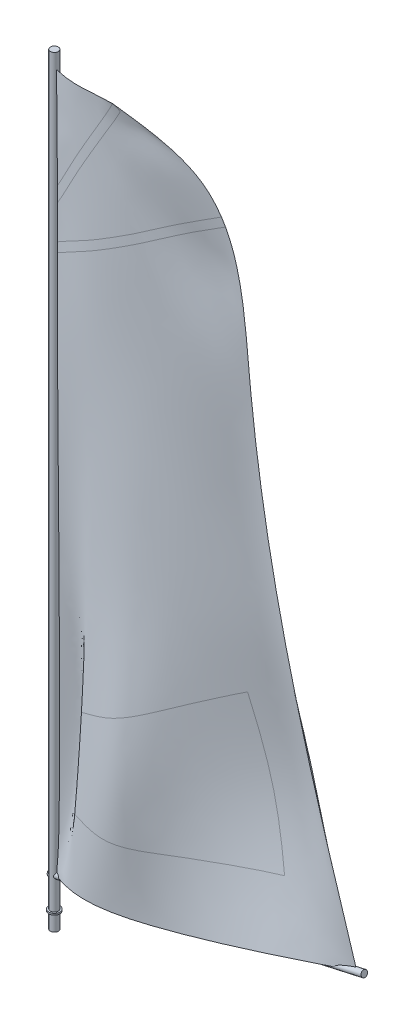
from build123d import *

# Parameters (mm, degrees)
EXTRUSION1_DEPTH      = 4500
EXTRUSION1_DEPTH_BACK = 300
ESQUISSE2_R           = 25
ESQUISSE17_R          = 20
EXTRUSION3_DEPTH      = 2025
ESQUISSE22_R          = 26.365837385
EXTRUSION4_DEPTH      = 66.656989
ESQUISSE32_R          = 35
BOSS_EXTRU_1_DEPTH    = 10


with BuildPart() as part:
    # Esquisse2 → Extrusion1 (new, two sides: drawn at the far end of the back side and taken through both)
    with BuildSketch(Plane(origin=(0, 0, 0), x_dir=(1, 0, 0), z_dir=(0, 1, 0)).offset(-EXTRUSION1_DEPTH_BACK)):
        with Locations(Location((0, 0, 0), (0, 0, 270))):
            Circle(ESQUISSE2_R)
    extrude(amount=EXTRUSION1_DEPTH + EXTRUSION1_DEPTH_BACK)

    # Esquisse17 → Extrusion3 (add)
    with BuildSketch(Plane(origin=(1957.389923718, 411.237256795, 0), x_dir=(0, 0, -1), z_dir=(-0.9762960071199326, -0.2164396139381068, 0))):
        with Locations(Location((0, -22.167427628, 0), (0, 0, 270))):
            Circle(ESQUISSE17_R)
    extrude(amount=EXTRUSION3_DEPTH)

    # Esquisse22 → Extrusion4 (add)
    with BuildSketch(Plane(origin=(781.036805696, 173.15169115, 0), x_dir=(0, 0, 1), z_dir=(-0.9762960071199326, -0.21643961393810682, 0))):
        with Locations((4.292040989, -17.466502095)):
            Circle(ESQUISSE22_R)
    extrude(amount=EXTRUSION4_DEPTH)

    # Esquisse32 → Boss.-Extru.1 (add)
    with BuildSketch(Plane(origin=(0, -200, 0), x_dir=(1, 0, 0), z_dir=(0, 1, 0))):
        with Locations(Location((0, 0, 0), (0, 0, 270))):
            Circle(ESQUISSE32_R)
    extrude(amount=BOSS_EXTRU_1_DEPTH)


solid = part.part
